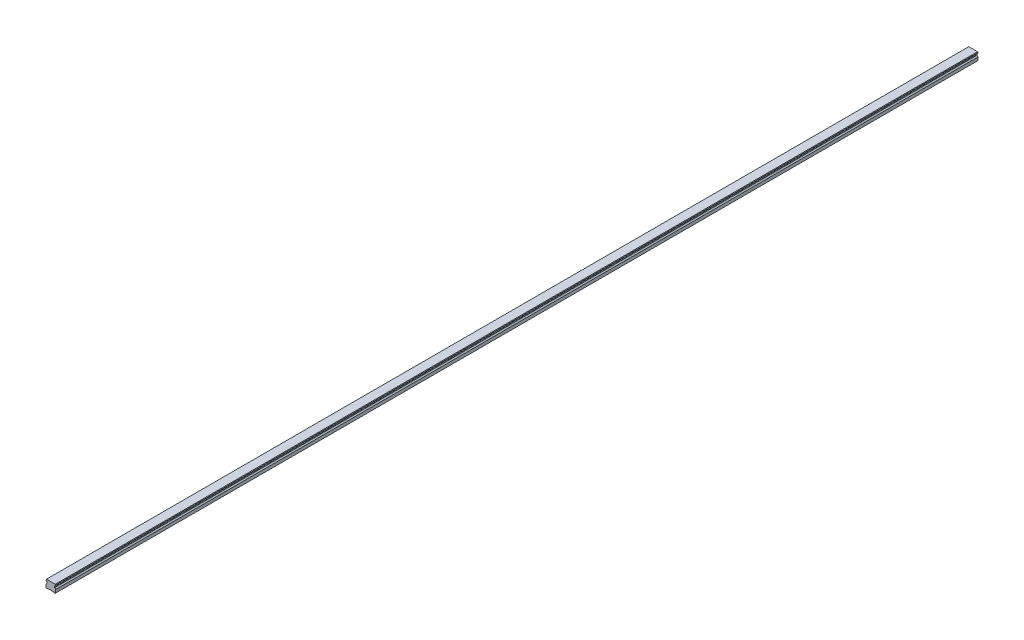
from build123d import *

# Parameters (mm, degrees)
SKETCH1_W           = 20
SKETCH1_H           = 16.3
BOSS_EXTRUDE1_DEPTH = 950
CUT_EXTRUDE1_DEPTH  = 1901.096231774
CHAMFER1_SIZE       = 1
FILLET1_R           = 1
CUT_EXTRUDE2_DEPTH  = 1901.096231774
SKETCH5_R           = 3
SKETCH5_R_2         = 2.5
CUT_EXTRUDE5_DEPTH  = 10
SKETCH5_2_R         = 2.5
CUT_EXTRUDE6_DEPTH  = 13
LPATTERN2_COUNT     = 32
LPATTERN2_PITCH     = 60


with BuildPart() as part:
    # Sketch1 → Boss-Extrude1 (new, symmetric)
    with BuildSketch(Plane.XY):
        with Locations((0, 8.15)):
            Rectangle(SKETCH1_W, SKETCH1_H)
    extrude(amount=BOSS_EXTRUDE1_DEPTH, both=True)

    # Sketch2 → Cut-Extrude1 (cut, through all)
    with BuildSketch(Plane.XY.offset(950)):
        Polygon((-10, 14.3), (-10, 7.3), (-7.666666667, 9.633333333), (-7.666666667, 11.966666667), align=None)
        Polygon((7.666666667, 11.966666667), (10, 14.3), (10, 7.3), (7.666666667, 9.633333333), align=None)
    extrude(amount=-CUT_EXTRUDE1_DEPTH, mode=Mode.SUBTRACT)

    # Chamfer1
    chamfer1_edges = [part.edges().sort_by_distance(p)[0] for p in [
        (-10, 16.3, 0),
        (10, 16.3, 0),
        (10, 0, 0),
        (-10, 0, 0),
    ]]
    chamfer(chamfer1_edges, length=CHAMFER1_SIZE)

    # Fillet1
    fillet1_edges = [part.edges().sort_by_distance(p)[0] for p in [
        (-7.666666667, 11.966666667, 0),
        (-7.666666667, 9.633333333, 0),
        (7.666666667, 9.633333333, 0),
        (7.666666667, 11.966666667, 0),
    ]]
    fillet(fillet1_edges, radius=FILLET1_R)

    # Sketch3 → Cut-Extrude2 (cut, through all)
    with BuildSketch(Plane.XY.offset(950)):
        Polygon((-6, 0), (-5, 1), (5, 1), (6, 0), align=None)
    extrude(amount=-CUT_EXTRUDE2_DEPTH, mode=Mode.SUBTRACT)

    # Sketch5 → Cut-Extrude5 (cut)
    with BuildSketch(Plane.XZ.offset(-1)):
        with Locations(Location((0, 930, 0), (0, 0, 270))):
            Circle(SKETCH5_R)
        with Locations(Location((0, 930, 0), (0, 0, 270))):
            Circle(SKETCH5_R_2, mode=Mode.SUBTRACT)
    cut_extrude5 = extrude(amount=-CUT_EXTRUDE5_DEPTH, mode=Mode.SUBTRACT)

    # Sketch5_2 → Cut-Extrude6 (cut)
    with BuildSketch(Plane.XZ.offset(-1)):
        with Locations(Location((0, 930, 0), (0, 0, 270))):
            Circle(SKETCH5_2_R)
    cut_extrude6 = extrude(amount=-CUT_EXTRUDE6_DEPTH, mode=Mode.SUBTRACT)

    # Cut-Extrude7 cone 1 section (on through the dimple's axis) → Cut-Extrude7 (revolve, cut)
    with BuildSketch(Plane(origin=(0, 14, 930), x_dir=(0, 0, -1), z_dir=(1, 0, 0))):
        Polygon((0, 0), (2.5, 0), (0, 1.443375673), align=None)
    cut_extrude7 = revolve(axis=Axis((0, 14, 930), (0, 1, 0)), mode=Mode.SUBTRACT)

    # LPattern2: Cut-Extrude5, Cut-Extrude6, Cut-Extrude7 ×32
    with Locations(*[(0, 0, -i * LPATTERN2_PITCH) for i in range(1, LPATTERN2_COUNT)]):
        add(cut_extrude5, mode=Mode.SUBTRACT)
        add(cut_extrude6, mode=Mode.SUBTRACT)
        add(cut_extrude7, mode=Mode.SUBTRACT)


solid = part.part
